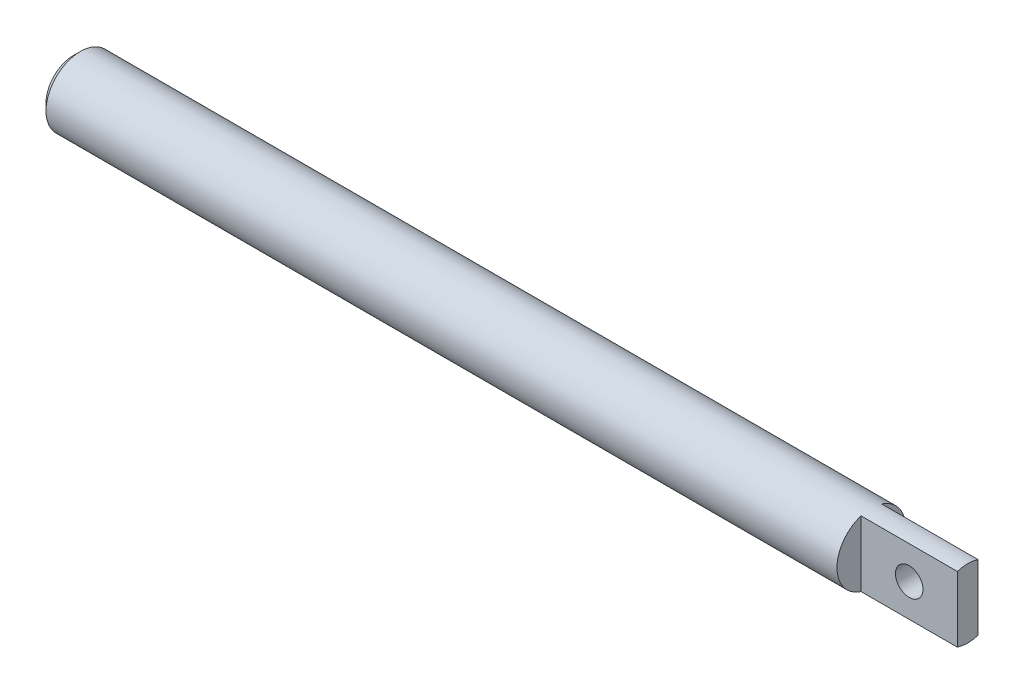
ISO-10303-21;
HEADER;
FILE_DESCRIPTION(('STEP AP214'),'2;1');
FILE_NAME('part.step','',(''),(''),'','','');
FILE_SCHEMA(('AUTOMOTIVE_DESIGN { 1 0 10303 214 1 1 1 1 }'));
ENDSEC;
DATA;
#1=APPLICATION_CONTEXT('core data for automotive mechanical design processes');
#2=APPLICATION_PROTOCOL_DEFINITION('international standard','automotive_design',2000,#1);
#3=PRODUCT_CONTEXT('',#1,'mechanical');
#4=PRODUCT('Part','Part','',(#3));
#5=PRODUCT_RELATED_PRODUCT_CATEGORY('part','',(#4));
#6=PRODUCT_DEFINITION_FORMATION('','',#4);
#7=PRODUCT_DEFINITION_CONTEXT('part definition',#1,'design');
#8=PRODUCT_DEFINITION('design','',#6,#7);
#9=PRODUCT_DEFINITION_SHAPE('','',#8);
#10=(LENGTH_UNIT() NAMED_UNIT(*) SI_UNIT(.MILLI.,.METRE.));
#11=(NAMED_UNIT(*) PLANE_ANGLE_UNIT() SI_UNIT($,.RADIAN.));
#12=(NAMED_UNIT(*) SI_UNIT($,.STERADIAN.) SOLID_ANGLE_UNIT());
#13=UNCERTAINTY_MEASURE_WITH_UNIT(LENGTH_MEASURE(1.E-05),#10,'distance_accuracy_value','');
#14=(GEOMETRIC_REPRESENTATION_CONTEXT(3) GLOBAL_UNCERTAINTY_ASSIGNED_CONTEXT((#13)) GLOBAL_UNIT_ASSIGNED_CONTEXT((#10,
#11,#12)) REPRESENTATION_CONTEXT('',''));
#15=CARTESIAN_POINT('',(0.,0.,0.));
#16=DIRECTION('',(0.,0.,1.));
#17=DIRECTION('',(1.,0.,0.));
#18=AXIS2_PLACEMENT_3D('',#15,#16,#17);
#19=CARTESIAN_POINT('',(0.,0.,0.));
#20=DIRECTION('',(1.,0.,0.));
#21=DIRECTION('',(0.,0.,-1.));
#22=AXIS2_PLACEMENT_3D('',#19,#20,#21);
#23=PLANE('',#22);
#24=CARTESIAN_POINT('',(0.,0.,0.));
#25=DIRECTION('',(-1.,0.,0.));
#26=DIRECTION('',(0.,0.,1.));
#27=AXIS2_PLACEMENT_3D('',#24,#25,#26);
#28=CIRCLE('',#27,4.);
#29=CARTESIAN_POINT('',(0.,0.,4.));
#30=VERTEX_POINT('',#29);
#31=EDGE_CURVE('E111',#30,#30,#28,.T.);
#32=ORIENTED_EDGE('',*,*,#31,.T.);
#33=EDGE_LOOP('',(#32));
#34=FACE_BOUND('',#33,.T.);
#35=ADVANCED_FACE('F32',(#34),#23,.F.);
#36=CARTESIAN_POINT('',(1.,0.,0.));
#37=DIRECTION('',(1.,0.,0.));
#38=DIRECTION('',(0.,0.,-1.));
#39=AXIS2_PLACEMENT_3D('',#36,#37,#38);
#40=CONICAL_SURFACE('',#39,5.,0.785398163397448);
#41=ORIENTED_EDGE('',*,*,#31,.F.);
#42=EDGE_LOOP('',(#41));
#43=FACE_BOUND('',#42,.T.);
#44=CARTESIAN_POINT('',(1.,0.,0.));
#45=DIRECTION('',(-1.,0.,0.));
#46=DIRECTION('',(0.,0.,1.));
#47=AXIS2_PLACEMENT_3D('',#44,#45,#46);
#48=CIRCLE('',#47,5.);
#49=CARTESIAN_POINT('',(1.,0.,5.));
#50=VERTEX_POINT('',#49);
#51=EDGE_CURVE('E114',#50,#50,#48,.T.);
#52=ORIENTED_EDGE('',*,*,#51,.T.);
#53=EDGE_LOOP('',(#52));
#54=FACE_BOUND('',#53,.T.);
#55=ADVANCED_FACE('F155',(#43,#54),#40,.T.);
#56=CARTESIAN_POINT('',(0.,0.,0.));
#57=DIRECTION('',(-1.,0.,0.));
#58=DIRECTION('',(0.,0.,1.));
#59=AXIS2_PLACEMENT_3D('',#56,#57,#58);
#60=CYLINDRICAL_SURFACE('',#59,5.);
#61=CARTESIAN_POINT('',(62.,0.,0.));
#62=DIRECTION('',(1.,0.,0.));
#63=DIRECTION('',(0.,0.,-1.));
#64=AXIS2_PLACEMENT_3D('',#61,#62,#63);
#65=CIRCLE('',#64,5.);
#66=CARTESIAN_POINT('',(62.,-4.,3.));
#67=VERTEX_POINT('',#66);
#68=CARTESIAN_POINT('',(62.,-4.,-3.));
#69=VERTEX_POINT('',#68);
#70=EDGE_CURVE('E39',#67,#69,#65,.T.);
#71=ORIENTED_EDGE('',*,*,#70,.T.);
#72=DIRECTION('',(-1.,0.,0.));
#73=VECTOR('',#72,1.);
#74=CARTESIAN_POINT('',(0.,-4.,-3.));
#75=LINE('',#74,#73);
#76=CARTESIAN_POINT('',(58.,-4.,-3.));
#77=VERTEX_POINT('',#76);
#78=EDGE_CURVE('E11',#69,#77,#75,.T.);
#79=ORIENTED_EDGE('',*,*,#78,.T.);
#80=CARTESIAN_POINT('',(58.,0.,0.));
#81=DIRECTION('',(-1.,0.,0.));
#82=DIRECTION('',(0.,0.,1.));
#83=AXIS2_PLACEMENT_3D('',#80,#81,#82);
#84=CIRCLE('',#83,5.);
#85=CARTESIAN_POINT('',(58.,-4.,3.));
#86=VERTEX_POINT('',#85);
#87=EDGE_CURVE('E96',#77,#86,#84,.T.);
#88=ORIENTED_EDGE('',*,*,#87,.T.);
#89=DIRECTION('',(-1.,0.,0.));
#90=VECTOR('',#89,1.);
#91=CARTESIAN_POINT('',(0.,-4.,3.));
#92=LINE('',#91,#90);
#93=EDGE_CURVE('E95',#86,#67,#92,.F.);
#94=ORIENTED_EDGE('',*,*,#93,.T.);
#95=EDGE_LOOP('',(#71,#79,#88,#94));
#96=FACE_BOUND('',#95,.T.);
#97=CARTESIAN_POINT('',(130.,0.,0.));
#98=DIRECTION('',(-1.,0.,0.));
#99=DIRECTION('',(0.,0.,1.));
#100=AXIS2_PLACEMENT_3D('',#97,#98,#99);
#101=CIRCLE('',#100,5.);
#102=CARTESIAN_POINT('',(130.,4.76969600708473,1.5));
#103=VERTEX_POINT('',#102);
#104=CARTESIAN_POINT('',(130.,4.76969600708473,-1.5));
#105=VERTEX_POINT('',#104);
#106=EDGE_CURVE('E117',#103,#105,#101,.T.);
#107=ORIENTED_EDGE('',*,*,#106,.T.);
#108=DIRECTION('',(-1.,0.,0.));
#109=VECTOR('',#108,1.);
#110=CARTESIAN_POINT('',(0.,4.76969600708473,-1.5));
#111=LINE('',#110,#109);
#112=CARTESIAN_POINT('',(116.,4.76969600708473,-1.5));
#113=VERTEX_POINT('',#112);
#114=EDGE_CURVE('E54',#105,#113,#111,.T.);
#115=ORIENTED_EDGE('',*,*,#114,.T.);
#116=CARTESIAN_POINT('',(116.,0.,0.));
#117=DIRECTION('',(-1.,0.,0.));
#118=DIRECTION('',(0.,0.,1.));
#119=AXIS2_PLACEMENT_3D('',#116,#117,#118);
#120=CIRCLE('',#119,5.);
#121=CARTESIAN_POINT('',(116.,-4.76969600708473,-1.5));
#122=VERTEX_POINT('',#121);
#123=EDGE_CURVE('E100',#113,#122,#120,.T.);
#124=ORIENTED_EDGE('',*,*,#123,.T.);
#125=DIRECTION('',(-1.,0.,0.));
#126=VECTOR('',#125,1.);
#127=CARTESIAN_POINT('',(0.,-4.76969600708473,-1.5));
#128=LINE('',#127,#126);
#129=CARTESIAN_POINT('',(130.,-4.76969600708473,-1.5));
#130=VERTEX_POINT('',#129);
#131=EDGE_CURVE('E131',#122,#130,#128,.F.);
#132=ORIENTED_EDGE('',*,*,#131,.T.);
#133=CARTESIAN_POINT('',(130.,-4.76969600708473,1.5));
#134=VERTEX_POINT('',#133);
#135=EDGE_CURVE('E120',#130,#134,#101,.T.);
#136=ORIENTED_EDGE('',*,*,#135,.T.);
#137=DIRECTION('',(-1.,0.,0.));
#138=VECTOR('',#137,1.);
#139=CARTESIAN_POINT('',(0.,-4.76969600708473,1.5));
#140=LINE('',#139,#138);
#141=CARTESIAN_POINT('',(116.,-4.76969600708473,1.5));
#142=VERTEX_POINT('',#141);
#143=EDGE_CURVE('E121',#134,#142,#140,.T.);
#144=ORIENTED_EDGE('',*,*,#143,.T.);
#145=CARTESIAN_POINT('',(116.,0.,0.));
#146=DIRECTION('',(-1.,0.,0.));
#147=DIRECTION('',(0.,0.,1.));
#148=AXIS2_PLACEMENT_3D('',#145,#146,#147);
#149=CIRCLE('',#148,5.);
#150=CARTESIAN_POINT('',(116.,4.76969600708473,1.5));
#151=VERTEX_POINT('',#150);
#152=EDGE_CURVE('E105',#142,#151,#149,.T.);
#153=ORIENTED_EDGE('',*,*,#152,.T.);
#154=DIRECTION('',(-1.,0.,0.));
#155=VECTOR('',#154,1.);
#156=CARTESIAN_POINT('',(0.,4.76969600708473,1.5));
#157=LINE('',#156,#155);
#158=EDGE_CURVE('E124',#151,#103,#157,.F.);
#159=ORIENTED_EDGE('',*,*,#158,.T.);
#160=EDGE_LOOP('',(#107,#115,#124,#132,#136,#144,#153,#159));
#161=FACE_BOUND('',#160,.T.);
#162=ORIENTED_EDGE('',*,*,#51,.F.);
#163=EDGE_LOOP('',(#162));
#164=FACE_BOUND('',#163,.T.);
#165=ADVANCED_FACE('F93',(#96,#161,#164),#60,.T.);
#166=CARTESIAN_POINT('',(130.,0.,0.));
#167=DIRECTION('',(-1.,0.,0.));
#168=DIRECTION('',(0.,0.,1.));
#169=AXIS2_PLACEMENT_3D('',#166,#167,#168);
#170=PLANE('',#169);
#171=ORIENTED_EDGE('',*,*,#135,.F.);
#172=DIRECTION('',(0.,1.,0.));
#173=VECTOR('',#172,1.);
#174=CARTESIAN_POINT('',(130.,0.,-1.5));
#175=LINE('',#174,#173);
#176=EDGE_CURVE('E103',#130,#105,#175,.T.);
#177=ORIENTED_EDGE('',*,*,#176,.T.);
#178=ORIENTED_EDGE('',*,*,#106,.F.);
#179=DIRECTION('',(0.,-1.,0.));
#180=VECTOR('',#179,1.);
#181=CARTESIAN_POINT('',(130.,0.,1.5));
#182=LINE('',#181,#180);
#183=EDGE_CURVE('E108',#103,#134,#182,.T.);
#184=ORIENTED_EDGE('',*,*,#183,.T.);
#185=EDGE_LOOP('',(#171,#177,#178,#184));
#186=FACE_BOUND('',#185,.T.);
#187=ADVANCED_FACE('F166',(#186),#170,.F.);
#188=CARTESIAN_POINT('',(116.,-5.,1.5));
#189=DIRECTION('',(-1.,0.,0.));
#190=DIRECTION('',(0.,0.,1.));
#191=AXIS2_PLACEMENT_3D('',#188,#189,#190);
#192=PLANE('',#191);
#193=DIRECTION('',(0.,1.,0.));
#194=VECTOR('',#193,1.);
#195=CARTESIAN_POINT('',(116.,5.,1.5));
#196=LINE('',#195,#194);
#197=EDGE_CURVE('E127',#142,#151,#196,.T.);
#198=ORIENTED_EDGE('',*,*,#197,.T.);
#199=ORIENTED_EDGE('',*,*,#152,.F.);
#200=EDGE_LOOP('',(#198,#199));
#201=FACE_BOUND('',#200,.T.);
#202=ADVANCED_FACE('F171',(#201),#192,.F.);
#203=CARTESIAN_POINT('',(116.,5.,1.5));
#204=DIRECTION('',(0.,0.,-1.));
#205=DIRECTION('',(-1.,0.,0.));
#206=AXIS2_PLACEMENT_3D('',#203,#204,#205);
#207=PLANE('',#206);
#208=CARTESIAN_POINT('',(123.,0.,1.5));
#209=DIRECTION('',(0.,0.,-1.));
#210=DIRECTION('',(-1.,0.,0.));
#211=AXIS2_PLACEMENT_3D('',#208,#209,#210);
#212=CIRCLE('',#211,2.);
#213=CARTESIAN_POINT('',(121.,0.,1.5));
#214=VERTEX_POINT('',#213);
#215=EDGE_CURVE('E137',#214,#214,#212,.T.);
#216=ORIENTED_EDGE('',*,*,#215,.T.);
#217=EDGE_LOOP('',(#216));
#218=FACE_BOUND('',#217,.T.);
#219=ORIENTED_EDGE('',*,*,#183,.F.);
#220=ORIENTED_EDGE('',*,*,#158,.F.);
#221=ORIENTED_EDGE('',*,*,#197,.F.);
#222=ORIENTED_EDGE('',*,*,#143,.F.);
#223=EDGE_LOOP('',(#219,#220,#221,#222));
#224=FACE_BOUND('',#223,.T.);
#225=ADVANCED_FACE('F175',(#218,#224),#207,.F.);
#226=CARTESIAN_POINT('',(116.,5.,-8.58945051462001));
#227=DIRECTION('',(-1.,0.,0.));
#228=DIRECTION('',(0.,0.,1.));
#229=AXIS2_PLACEMENT_3D('',#226,#227,#228);
#230=PLANE('',#229);
#231=DIRECTION('',(0.,-1.,0.));
#232=VECTOR('',#231,1.);
#233=CARTESIAN_POINT('',(116.,5.,-1.5));
#234=LINE('',#233,#232);
#235=EDGE_CURVE('E134',#113,#122,#234,.T.);
#236=ORIENTED_EDGE('',*,*,#235,.T.);
#237=ORIENTED_EDGE('',*,*,#123,.F.);
#238=EDGE_LOOP('',(#236,#237));
#239=FACE_BOUND('',#238,.T.);
#240=ADVANCED_FACE('F178',(#239),#230,.F.);
#241=CARTESIAN_POINT('',(116.,5.,-1.5));
#242=DIRECTION('',(0.,0.,1.));
#243=DIRECTION('',(1.,0.,0.));
#244=AXIS2_PLACEMENT_3D('',#241,#242,#243);
#245=PLANE('',#244);
#246=CARTESIAN_POINT('',(123.,0.,-1.5));
#247=DIRECTION('',(0.,0.,-1.));
#248=DIRECTION('',(-1.,0.,0.));
#249=AXIS2_PLACEMENT_3D('',#246,#247,#248);
#250=CIRCLE('',#249,2.);
#251=CARTESIAN_POINT('',(121.,0.,-1.5));
#252=VERTEX_POINT('',#251);
#253=EDGE_CURVE('E140',#252,#252,#250,.T.);
#254=ORIENTED_EDGE('',*,*,#253,.F.);
#255=EDGE_LOOP('',(#254));
#256=FACE_BOUND('',#255,.T.);
#257=ORIENTED_EDGE('',*,*,#176,.F.);
#258=ORIENTED_EDGE('',*,*,#131,.F.);
#259=ORIENTED_EDGE('',*,*,#235,.F.);
#260=ORIENTED_EDGE('',*,*,#114,.F.);
#261=EDGE_LOOP('',(#257,#258,#259,#260));
#262=FACE_BOUND('',#261,.T.);
#263=ADVANCED_FACE('F183',(#256,#262),#245,.F.);
#264=CARTESIAN_POINT('',(123.,0.,5.));
#265=DIRECTION('',(0.,0.,-1.));
#266=DIRECTION('',(-1.,0.,0.));
#267=AXIS2_PLACEMENT_3D('',#264,#265,#266);
#268=CYLINDRICAL_SURFACE('',#267,2.);
#269=ORIENTED_EDGE('',*,*,#253,.T.);
#270=EDGE_LOOP('',(#269));
#271=FACE_BOUND('',#270,.T.);
#272=ORIENTED_EDGE('',*,*,#215,.F.);
#273=EDGE_LOOP('',(#272));
#274=FACE_BOUND('',#273,.T.);
#275=ADVANCED_FACE('F152',(#271,#274),#268,.F.);
#276=CARTESIAN_POINT('',(62.,-4.,-35.));
#277=DIRECTION('',(1.,0.,0.));
#278=DIRECTION('',(0.,0.,-1.));
#279=AXIS2_PLACEMENT_3D('',#276,#277,#278);
#280=PLANE('',#279);
#281=DIRECTION('',(0.,0.,1.));
#282=VECTOR('',#281,1.);
#283=CARTESIAN_POINT('',(62.,-4.,-35.));
#284=LINE('',#283,#282);
#285=EDGE_CURVE('E46',#69,#67,#284,.T.);
#286=ORIENTED_EDGE('',*,*,#285,.F.);
#287=ORIENTED_EDGE('',*,*,#70,.F.);
#288=EDGE_LOOP('',(#286,#287));
#289=FACE_BOUND('',#288,.T.);
#290=ADVANCED_FACE('F90',(#289),#280,.F.);
#291=CARTESIAN_POINT('',(58.,-4.,-35.));
#292=DIRECTION('',(-1.,0.,0.));
#293=DIRECTION('',(0.,0.,1.));
#294=AXIS2_PLACEMENT_3D('',#291,#292,#293);
#295=PLANE('',#294);
#296=DIRECTION('',(0.,0.,1.));
#297=VECTOR('',#296,1.);
#298=CARTESIAN_POINT('',(58.,-4.,-35.));
#299=LINE('',#298,#297);
#300=EDGE_CURVE('E85',#77,#86,#299,.T.);
#301=ORIENTED_EDGE('',*,*,#300,.T.);
#302=ORIENTED_EDGE('',*,*,#87,.F.);
#303=EDGE_LOOP('',(#301,#302));
#304=FACE_BOUND('',#303,.T.);
#305=ADVANCED_FACE('F144',(#304),#295,.F.);
#306=CARTESIAN_POINT('',(58.,-4.,-35.));
#307=DIRECTION('',(0.,1.,0.));
#308=DIRECTION('',(0.,0.,1.));
#309=AXIS2_PLACEMENT_3D('',#306,#307,#308);
#310=PLANE('',#309);
#311=ORIENTED_EDGE('',*,*,#285,.T.);
#312=ORIENTED_EDGE('',*,*,#93,.F.);
#313=ORIENTED_EDGE('',*,*,#300,.F.);
#314=ORIENTED_EDGE('',*,*,#78,.F.);
#315=EDGE_LOOP('',(#311,#312,#313,#314));
#316=FACE_BOUND('',#315,.T.);
#317=ADVANCED_FACE('F83',(#316),#310,.F.);
#318=CLOSED_SHELL('',(#35,#55,#165,#187,#202,#225,#240,#263,#275,#290,#305,#317));
#319=MANIFOLD_SOLID_BREP('B2',#318);
#320=ADVANCED_BREP_SHAPE_REPRESENTATION('',(#18,#319),#14);
#321=SHAPE_DEFINITION_REPRESENTATION(#9,#320);
ENDSEC;
END-ISO-10303-21;
